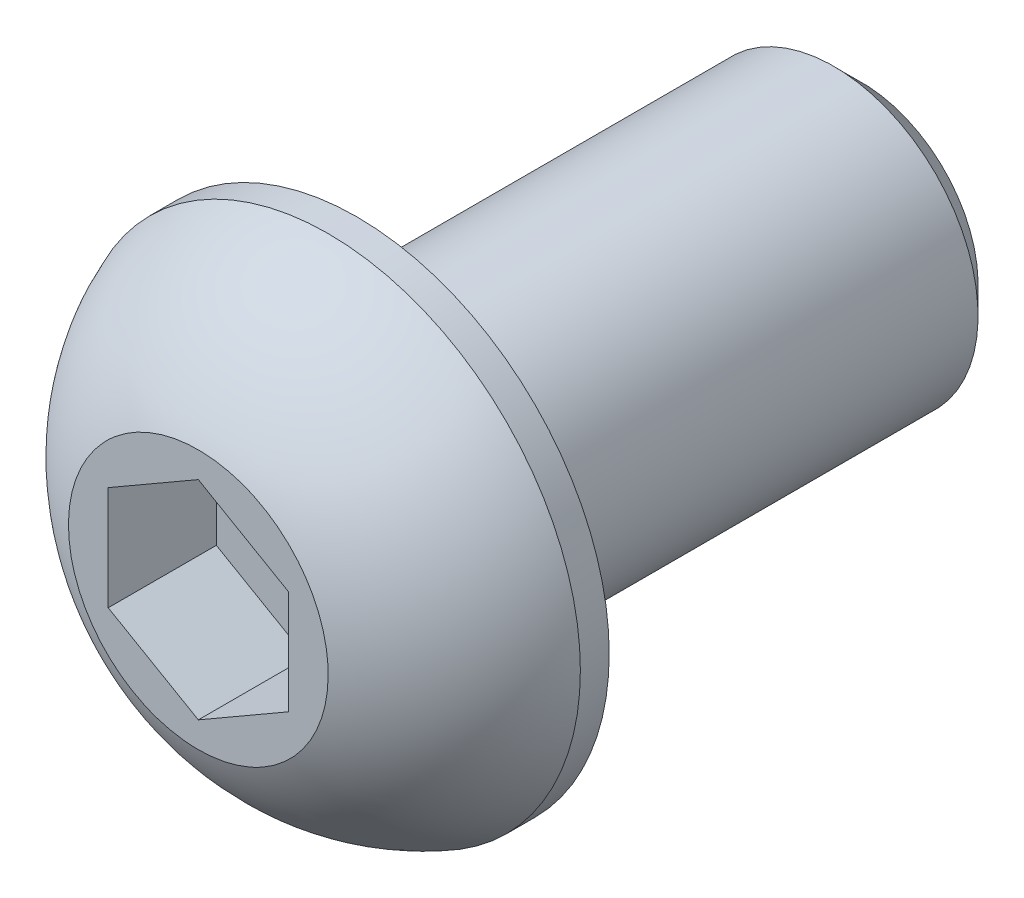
ISO-10303-21;
HEADER;
FILE_DESCRIPTION(('STEP AP214'),'2;1');
FILE_NAME('part.step','',(''),(''),'','','');
FILE_SCHEMA(('AUTOMOTIVE_DESIGN { 1 0 10303 214 1 1 1 1 }'));
ENDSEC;
DATA;
#1=APPLICATION_CONTEXT('core data for automotive mechanical design processes');
#2=APPLICATION_PROTOCOL_DEFINITION('international standard','automotive_design',2000,#1);
#3=PRODUCT_CONTEXT('',#1,'mechanical');
#4=PRODUCT('Part','Part','',(#3));
#5=PRODUCT_RELATED_PRODUCT_CATEGORY('part','',(#4));
#6=PRODUCT_DEFINITION_FORMATION('','',#4);
#7=PRODUCT_DEFINITION_CONTEXT('part definition',#1,'design');
#8=PRODUCT_DEFINITION('design','',#6,#7);
#9=PRODUCT_DEFINITION_SHAPE('','',#8);
#10=(LENGTH_UNIT() NAMED_UNIT(*) SI_UNIT(.MILLI.,.METRE.));
#11=(NAMED_UNIT(*) PLANE_ANGLE_UNIT() SI_UNIT($,.RADIAN.));
#12=(NAMED_UNIT(*) SI_UNIT($,.STERADIAN.) SOLID_ANGLE_UNIT());
#13=UNCERTAINTY_MEASURE_WITH_UNIT(LENGTH_MEASURE(1.E-05),#10,'distance_accuracy_value','');
#14=(GEOMETRIC_REPRESENTATION_CONTEXT(3) GLOBAL_UNCERTAINTY_ASSIGNED_CONTEXT((#13)) GLOBAL_UNIT_ASSIGNED_CONTEXT((#10,
#11,#12)) REPRESENTATION_CONTEXT('',''));
#15=CARTESIAN_POINT('',(0.,0.,0.));
#16=DIRECTION('',(0.,0.,1.));
#17=DIRECTION('',(1.,0.,0.));
#18=AXIS2_PLACEMENT_3D('',#15,#16,#17);
#19=CARTESIAN_POINT('',(0.,0.,1.4));
#20=DIRECTION('',(0.,0.,-1.));
#21=DIRECTION('',(-1.,0.,0.));
#22=AXIS2_PLACEMENT_3D('',#19,#20,#21);
#23=PLANE('',#22);
#24=DIRECTION('',(-0.866025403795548,0.499999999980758,0.));
#25=VECTOR('',#24,1.);
#26=CARTESIAN_POINT('',(1.25,2.16506350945,1.4));
#27=LINE('',#26,#25);
#28=CARTESIAN_POINT('',(2.5,1.443375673,1.4));
#29=VERTEX_POINT('',#28);
#30=CARTESIAN_POINT('',(0.,2.8867513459,1.4));
#31=VERTEX_POINT('',#30);
#32=EDGE_CURVE('E227',#29,#31,#27,.T.);
#33=ORIENTED_EDGE('',*,*,#32,.T.);
#34=DIRECTION('',(-0.866025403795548,-0.499999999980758,0.));
#35=VECTOR('',#34,1.);
#36=CARTESIAN_POINT('',(-1.25,2.16506350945,1.4));
#37=LINE('',#36,#35);
#38=CARTESIAN_POINT('',(-2.5,1.443375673,1.4));
#39=VERTEX_POINT('',#38);
#40=EDGE_CURVE('E232',#31,#39,#37,.T.);
#41=ORIENTED_EDGE('',*,*,#40,.T.);
#42=DIRECTION('',(0.,1.,0.));
#43=VECTOR('',#42,1.);
#44=CARTESIAN_POINT('',(-2.5,0.,1.4));
#45=LINE('',#44,#43);
#46=CARTESIAN_POINT('',(-2.5,-1.443375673,1.4));
#47=VERTEX_POINT('',#46);
#48=EDGE_CURVE('E237',#39,#47,#45,.F.);
#49=ORIENTED_EDGE('',*,*,#48,.T.);
#50=DIRECTION('',(0.866025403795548,-0.499999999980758,0.));
#51=VECTOR('',#50,1.);
#52=CARTESIAN_POINT('',(-1.25,-2.16506350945,1.4));
#53=LINE('',#52,#51);
#54=CARTESIAN_POINT('',(0.,-2.8867513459,1.4));
#55=VERTEX_POINT('',#54);
#56=EDGE_CURVE('E94',#47,#55,#53,.T.);
#57=ORIENTED_EDGE('',*,*,#56,.T.);
#58=DIRECTION('',(0.866025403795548,0.499999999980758,0.));
#59=VECTOR('',#58,1.);
#60=CARTESIAN_POINT('',(1.25,-2.16506350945,1.4));
#61=LINE('',#60,#59);
#62=CARTESIAN_POINT('',(2.5,-1.443375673,1.4));
#63=VERTEX_POINT('',#62);
#64=EDGE_CURVE('E78',#55,#63,#61,.T.);
#65=ORIENTED_EDGE('',*,*,#64,.T.);
#66=DIRECTION('',(0.,1.,0.));
#67=VECTOR('',#66,1.);
#68=CARTESIAN_POINT('',(2.5,0.7216878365,1.4));
#69=LINE('',#68,#67);
#70=EDGE_CURVE('E83',#63,#29,#69,.T.);
#71=ORIENTED_EDGE('',*,*,#70,.T.);
#72=EDGE_LOOP('',(#33,#41,#49,#57,#65,#71));
#73=FACE_BOUND('',#72,.T.);
#74=ADVANCED_FACE('F20',(#73),#23,.F.);
#75=CARTESIAN_POINT('',(2.5,0.7216878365,4.4));
#76=DIRECTION('',(1.,0.,0.));
#77=DIRECTION('',(0.,0.,-1.));
#78=AXIS2_PLACEMENT_3D('',#75,#76,#77);
#79=PLANE('',#78);
#80=DIRECTION('',(0.,0.,1.));
#81=VECTOR('',#80,1.);
#82=CARTESIAN_POINT('',(2.5,-1.443375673,4.4));
#83=LINE('',#82,#81);
#84=CARTESIAN_POINT('',(2.5,-1.443375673,4.39999999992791));
#85=VERTEX_POINT('',#84);
#86=EDGE_CURVE('E85',#63,#85,#83,.T.);
#87=ORIENTED_EDGE('',*,*,#86,.T.);
#88=DIRECTION('',(0.,1.,0.));
#89=VECTOR('',#88,1.);
#90=CARTESIAN_POINT('',(2.5,0.,4.39999999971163));
#91=LINE('',#90,#89);
#92=CARTESIAN_POINT('',(2.5,1.443375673,4.39999999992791));
#93=VERTEX_POINT('',#92);
#94=EDGE_CURVE('E225',#93,#85,#91,.F.);
#95=ORIENTED_EDGE('',*,*,#94,.F.);
#96=DIRECTION('',(0.,0.,1.));
#97=VECTOR('',#96,1.);
#98=CARTESIAN_POINT('',(2.5,1.443375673,4.4));
#99=LINE('',#98,#97);
#100=EDGE_CURVE('E88',#93,#29,#99,.F.);
#101=ORIENTED_EDGE('',*,*,#100,.T.);
#102=ORIENTED_EDGE('',*,*,#70,.F.);
#103=EDGE_LOOP('',(#87,#95,#101,#102));
#104=FACE_BOUND('',#103,.T.);
#105=ADVANCED_FACE('F84',(#104),#79,.F.);
#106=CARTESIAN_POINT('',(1.25,-2.16506350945,4.4));
#107=DIRECTION('',(0.499999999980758,-0.866025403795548,0.));
#108=DIRECTION('',(0.866025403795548,0.499999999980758,0.));
#109=AXIS2_PLACEMENT_3D('',#106,#107,#108);
#110=PLANE('',#109);
#111=DIRECTION('',(0.,0.,1.));
#112=VECTOR('',#111,1.);
#113=CARTESIAN_POINT('',(0.,-2.8867513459,4.4));
#114=LINE('',#113,#112);
#115=CARTESIAN_POINT('',(0.,-2.8867513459,4.39999999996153));
#116=VERTEX_POINT('',#115);
#117=EDGE_CURVE('E96',#55,#116,#114,.T.);
#118=ORIENTED_EDGE('',*,*,#117,.T.);
#119=DIRECTION('',(-0.866025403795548,-0.499999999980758,4.65924845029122E-11));
#120=VECTOR('',#119,1.);
#121=CARTESIAN_POINT('',(2.5,-1.443375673,4.39999999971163));
#122=LINE('',#121,#120);
#123=EDGE_CURVE('E100',#85,#116,#122,.T.);
#124=ORIENTED_EDGE('',*,*,#123,.F.);
#125=ORIENTED_EDGE('',*,*,#86,.F.);
#126=ORIENTED_EDGE('',*,*,#64,.F.);
#127=EDGE_LOOP('',(#118,#124,#125,#126));
#128=FACE_BOUND('',#127,.T.);
#129=ADVANCED_FACE('F98',(#128),#110,.F.);
#130=CARTESIAN_POINT('',(-1.25,-2.16506350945,4.4));
#131=DIRECTION('',(-0.499999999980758,-0.866025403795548,0.));
#132=DIRECTION('',(0.866025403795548,-0.499999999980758,0.));
#133=AXIS2_PLACEMENT_3D('',#130,#131,#132);
#134=PLANE('',#133);
#135=DIRECTION('',(0.,0.,1.));
#136=VECTOR('',#135,1.);
#137=CARTESIAN_POINT('',(-2.5,-1.443375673,4.4));
#138=LINE('',#137,#136);
#139=CARTESIAN_POINT('',(-2.5,-1.443375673,4.39999999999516));
#140=VERTEX_POINT('',#139);
#141=EDGE_CURVE('E239',#47,#140,#138,.T.);
#142=ORIENTED_EDGE('',*,*,#141,.T.);
#143=DIRECTION('',(-0.866025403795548,0.499999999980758,4.65924845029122E-11));
#144=VECTOR('',#143,1.);
#145=CARTESIAN_POINT('',(0.,-2.8867513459,4.39999999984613));
#146=LINE('',#145,#144);
#147=EDGE_CURVE('E221',#116,#140,#146,.T.);
#148=ORIENTED_EDGE('',*,*,#147,.F.);
#149=ORIENTED_EDGE('',*,*,#117,.F.);
#150=ORIENTED_EDGE('',*,*,#56,.F.);
#151=EDGE_LOOP('',(#142,#148,#149,#150));
#152=FACE_BOUND('',#151,.T.);
#153=ADVANCED_FACE('F141',(#152),#134,.F.);
#154=CARTESIAN_POINT('',(-2.5,0.,4.4));
#155=DIRECTION('',(-1.,0.,0.));
#156=DIRECTION('',(0.,0.,1.));
#157=AXIS2_PLACEMENT_3D('',#154,#155,#156);
#158=PLANE('',#157);
#159=DIRECTION('',(0.,0.,1.));
#160=VECTOR('',#159,1.);
#161=CARTESIAN_POINT('',(-2.5,1.443375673,4.4));
#162=LINE('',#161,#160);
#163=CARTESIAN_POINT('',(-2.5,1.443375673,4.39999999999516));
#164=VERTEX_POINT('',#163);
#165=EDGE_CURVE('E235',#39,#164,#162,.T.);
#166=ORIENTED_EDGE('',*,*,#165,.T.);
#167=DIRECTION('',(0.,1.,0.));
#168=VECTOR('',#167,1.);
#169=CARTESIAN_POINT('',(-2.5,0.,4.39999999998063));
#170=LINE('',#169,#168);
#171=EDGE_CURVE('E218',#140,#164,#170,.T.);
#172=ORIENTED_EDGE('',*,*,#171,.F.);
#173=ORIENTED_EDGE('',*,*,#141,.F.);
#174=ORIENTED_EDGE('',*,*,#48,.F.);
#175=EDGE_LOOP('',(#166,#172,#173,#174));
#176=FACE_BOUND('',#175,.T.);
#177=ADVANCED_FACE('F137',(#176),#158,.F.);
#178=CARTESIAN_POINT('',(-1.25,2.16506350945,4.4));
#179=DIRECTION('',(-0.499999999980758,0.866025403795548,0.));
#180=DIRECTION('',(-0.866025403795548,-0.499999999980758,0.));
#181=AXIS2_PLACEMENT_3D('',#178,#179,#180);
#182=PLANE('',#181);
#183=DIRECTION('',(0.,0.,1.));
#184=VECTOR('',#183,1.);
#185=CARTESIAN_POINT('',(0.,2.8867513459,4.4));
#186=LINE('',#185,#184);
#187=CARTESIAN_POINT('',(0.,2.8867513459,4.39999999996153));
#188=VERTEX_POINT('',#187);
#189=EDGE_CURVE('E230',#31,#188,#186,.T.);
#190=ORIENTED_EDGE('',*,*,#189,.T.);
#191=DIRECTION('',(0.866025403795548,0.499999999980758,-4.65924845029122E-11));
#192=VECTOR('',#191,1.);
#193=CARTESIAN_POINT('',(-2.5,1.443375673,4.39999999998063));
#194=LINE('',#193,#192);
#195=EDGE_CURVE('E215',#164,#188,#194,.T.);
#196=ORIENTED_EDGE('',*,*,#195,.F.);
#197=ORIENTED_EDGE('',*,*,#165,.F.);
#198=ORIENTED_EDGE('',*,*,#40,.F.);
#199=EDGE_LOOP('',(#190,#196,#197,#198));
#200=FACE_BOUND('',#199,.T.);
#201=ADVANCED_FACE('F133',(#200),#182,.F.);
#202=CARTESIAN_POINT('',(1.25,2.16506350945,4.4));
#203=DIRECTION('',(0.499999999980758,0.866025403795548,0.));
#204=DIRECTION('',(-0.866025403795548,0.499999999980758,0.));
#205=AXIS2_PLACEMENT_3D('',#202,#203,#204);
#206=PLANE('',#205);
#207=ORIENTED_EDGE('',*,*,#100,.F.);
#208=DIRECTION('',(0.866025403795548,-0.499999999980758,-4.65924845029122E-11));
#209=VECTOR('',#208,1.);
#210=CARTESIAN_POINT('',(0.,2.8867513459,4.39999999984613));
#211=LINE('',#210,#209);
#212=EDGE_CURVE('E120',#188,#93,#211,.T.);
#213=ORIENTED_EDGE('',*,*,#212,.F.);
#214=ORIENTED_EDGE('',*,*,#189,.F.);
#215=ORIENTED_EDGE('',*,*,#32,.F.);
#216=EDGE_LOOP('',(#207,#213,#214,#215));
#217=FACE_BOUND('',#216,.T.);
#218=ADVANCED_FACE('F129',(#217),#206,.F.);
#219=CARTESIAN_POINT('',(-3.23151399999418,0.,4.40000000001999));
#220=DIRECTION('',(5.38003067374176E-11,0.,1.));
#221=DIRECTION('',(1.,0.,-5.38003067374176E-11));
#222=AXIS2_PLACEMENT_3D('',#219,#220,#221);
#223=PLANE('',#222);
#224=CARTESIAN_POINT('',(3.60302800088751,0.,4.39999999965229));
#225=CARTESIAN_POINT('',(3.60302739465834,-0.101161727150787,4.39999999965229));
#226=CARTESIAN_POINT('',(3.59876373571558,-0.202342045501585,4.39999999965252));
#227=CARTESIAN_POINT('',(3.5817368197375,-0.404003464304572,4.39999999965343));
#228=CARTESIAN_POINT('',(3.56897105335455,-0.504484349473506,4.39999999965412));
#229=CARTESIAN_POINT('',(3.53499735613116,-0.704182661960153,4.39999999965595));
#230=CARTESIAN_POINT('',(3.51377602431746,-0.803397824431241,4.39999999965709));
#231=CARTESIAN_POINT('',(3.46303747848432,-0.999742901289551,4.39999999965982));
#232=CARTESIAN_POINT('',(3.43351353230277,-1.0968710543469,4.39999999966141));
#233=CARTESIAN_POINT('',(3.33289595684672,-1.38366869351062,4.39999999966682));
#234=CARTESIAN_POINT('',(3.2496739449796,-1.56923401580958,4.3999999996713));
#235=CARTESIAN_POINT('',(3.05321325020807,-1.92373837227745,4.39999999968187));
#236=CARTESIAN_POINT('',(2.93997342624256,-2.09267677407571,4.39999999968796));
#237=CARTESIAN_POINT('',(2.7501783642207,-2.3299437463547,4.39999999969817));
#238=CARTESIAN_POINT('',(2.68354067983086,-2.40638732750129,4.39999999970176));
#239=CARTESIAN_POINT('',(2.54411499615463,-2.55333638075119,4.39999999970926));
#240=CARTESIAN_POINT('',(2.47133298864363,-2.62384750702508,4.39999999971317));
#241=CARTESIAN_POINT('',(2.32005283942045,-2.75851860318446,4.39999999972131));
#242=CARTESIAN_POINT('',(2.2415521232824,-2.82267568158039,4.39999999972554));
#243=CARTESIAN_POINT('',(2.07943216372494,-2.94415515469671,4.39999999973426));
#244=CARTESIAN_POINT('',(1.9958117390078,-3.00147596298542,4.39999999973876));
#245=CARTESIAN_POINT('',(1.73818269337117,-3.16250597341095,4.39999999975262));
#246=CARTESIAN_POINT('',(1.5572464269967,-3.25542481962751,4.39999999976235));
#247=CARTESIAN_POINT('',(1.18243980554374,-3.40951047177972,4.39999999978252));
#248=CARTESIAN_POINT('',(0.988569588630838,-3.47067761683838,4.39999999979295));
#249=CARTESIAN_POINT('',(0.593286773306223,-3.55961210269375,4.39999999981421));
#250=CARTESIAN_POINT('',(0.391874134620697,-3.58737926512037,4.39999999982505));
#251=CARTESIAN_POINT('',(-0.0127538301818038,-3.60869681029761,4.39999999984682));
#252=CARTESIAN_POINT('',(-0.21596915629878,-3.60224719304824,4.39999999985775));
#253=CARTESIAN_POINT('',(-0.618408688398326,-3.55534015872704,4.3999999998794));
#254=CARTESIAN_POINT('',(-0.817632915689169,-3.51488292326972,4.39999999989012));
#255=CARTESIAN_POINT('',(-1.20655549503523,-3.40103381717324,4.39999999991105));
#256=CARTESIAN_POINT('',(-1.39625374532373,-3.3276415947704,4.39999999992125));
#257=CARTESIAN_POINT('',(-1.66937712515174,-3.19457390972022,4.39999999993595));
#258=CARTESIAN_POINT('',(-1.75855773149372,-3.14635700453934,4.39999999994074));
#259=CARTESIAN_POINT('',(-1.93254490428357,-3.04258510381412,4.3999999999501));
#260=CARTESIAN_POINT('',(-2.01735247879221,-2.98703181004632,4.39999999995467));
#261=CARTESIAN_POINT('',(-2.18194598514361,-2.86900229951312,4.39999999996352));
#262=CARTESIAN_POINT('',(-2.26173417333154,-2.80652922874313,4.39999999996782));
#263=CARTESIAN_POINT('',(-2.41582896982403,-2.67504409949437,4.39999999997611));
#264=CARTESIAN_POINT('',(-2.49013021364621,-2.60602578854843,4.3999999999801));
#265=CARTESIAN_POINT('',(-2.70380588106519,-2.39001539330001,4.3999999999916));
#266=CARTESIAN_POINT('',(-2.83417035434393,-2.23391111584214,4.39999999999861));
#267=CARTESIAN_POINT('',(-3.0667937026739,-1.90201275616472,4.40000000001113));
#268=CARTESIAN_POINT('',(-3.16905364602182,-1.7262194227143,4.40000000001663));
#269=CARTESIAN_POINT('',(-3.29925003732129,-1.45158205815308,4.40000000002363));
#270=CARTESIAN_POINT('',(-3.3388164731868,-1.35809388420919,4.40000000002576));
#271=CARTESIAN_POINT('',(-3.40990547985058,-1.16816720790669,4.40000000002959));
#272=CARTESIAN_POINT('',(-3.44143456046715,-1.07173116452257,4.40000000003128));
#273=CARTESIAN_POINT('',(-3.49620387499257,-0.876708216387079,4.40000000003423));
#274=CARTESIAN_POINT('',(-3.51945719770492,-0.778124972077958,4.40000000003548));
#275=CARTESIAN_POINT('',(-3.5575798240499,-0.579369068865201,4.40000000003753));
#276=CARTESIAN_POINT('',(-3.57245160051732,-0.479196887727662,4.40000000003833));
#277=CARTESIAN_POINT('',(-3.58972538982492,-0.3157245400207,4.40000000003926));
#278=CARTESIAN_POINT('',(-3.59471229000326,-0.252686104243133,4.40000000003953));
#279=CARTESIAN_POINT('',(-3.60136378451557,-0.12643419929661,4.40000000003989));
#280=CARTESIAN_POINT('',(-3.60302837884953,-0.0632207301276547,4.40000000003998));
#281=CARTESIAN_POINT('',(-3.60302739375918,0.101161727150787,4.40000000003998));
#282=CARTESIAN_POINT('',(-3.59876373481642,0.202342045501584,4.40000000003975));
#283=CARTESIAN_POINT('',(-3.58173681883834,0.40400346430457,4.40000000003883));
#284=CARTESIAN_POINT('',(-3.56897105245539,0.504484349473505,4.40000000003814));
#285=CARTESIAN_POINT('',(-3.534997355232,0.704182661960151,4.40000000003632));
#286=CARTESIAN_POINT('',(-3.5137760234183,0.803397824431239,4.40000000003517));
#287=CARTESIAN_POINT('',(-3.46303747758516,0.99974290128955,4.40000000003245));
#288=CARTESIAN_POINT('',(-3.43351353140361,1.0968710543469,4.40000000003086));
#289=CARTESIAN_POINT('',(-3.33289595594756,1.38366869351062,4.40000000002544));
#290=CARTESIAN_POINT('',(-3.24967394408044,1.56923401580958,4.40000000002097));
#291=CARTESIAN_POINT('',(-3.05321324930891,1.92373837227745,4.4000000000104));
#292=CARTESIAN_POINT('',(-2.93997342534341,2.09267677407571,4.4000000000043));
#293=CARTESIAN_POINT('',(-2.75017836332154,2.3299437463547,4.39999999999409));
#294=CARTESIAN_POINT('',(-2.6835406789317,2.40638732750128,4.39999999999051));
#295=CARTESIAN_POINT('',(-2.54411499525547,2.55333638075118,4.39999999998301));
#296=CARTESIAN_POINT('',(-2.47133298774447,2.62384750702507,4.39999999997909));
#297=CARTESIAN_POINT('',(-2.3200528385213,2.75851860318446,4.39999999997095));
#298=CARTESIAN_POINT('',(-2.24155212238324,2.82267568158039,4.39999999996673));
#299=CARTESIAN_POINT('',(-2.07943216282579,2.94415515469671,4.39999999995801));
#300=CARTESIAN_POINT('',(-1.99581173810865,3.00147596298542,4.39999999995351));
#301=CARTESIAN_POINT('',(-1.73818269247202,3.16250597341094,4.39999999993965));
#302=CARTESIAN_POINT('',(-1.55724642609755,3.2554248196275,4.39999999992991));
#303=CARTESIAN_POINT('',(-1.18243980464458,3.40951047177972,4.39999999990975));
#304=CARTESIAN_POINT('',(-0.988569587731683,3.47067761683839,4.39999999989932));
#305=CARTESIAN_POINT('',(-0.593286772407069,3.55961210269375,4.39999999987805));
#306=CARTESIAN_POINT('',(-0.391874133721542,3.58737926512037,4.39999999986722));
#307=CARTESIAN_POINT('',(0.0127538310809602,3.60869681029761,4.39999999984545));
#308=CARTESIAN_POINT('',(0.215969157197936,3.60224719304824,4.39999999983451));
#309=CARTESIAN_POINT('',(0.618408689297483,3.55534015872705,4.39999999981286));
#310=CARTESIAN_POINT('',(0.817632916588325,3.51488292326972,4.39999999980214));
#311=CARTESIAN_POINT('',(1.20655549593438,3.40103381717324,4.39999999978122));
#312=CARTESIAN_POINT('',(1.39625374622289,3.32764159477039,4.39999999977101));
#313=CARTESIAN_POINT('',(1.66937712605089,3.19457390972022,4.39999999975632));
#314=CARTESIAN_POINT('',(1.75855773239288,3.14635700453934,4.39999999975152));
#315=CARTESIAN_POINT('',(1.93254490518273,3.04258510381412,4.39999999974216));
#316=CARTESIAN_POINT('',(2.01735247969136,2.98703181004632,4.3999999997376));
#317=CARTESIAN_POINT('',(2.18194598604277,2.86900229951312,4.39999999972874));
#318=CARTESIAN_POINT('',(2.2617341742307,2.80652922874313,4.39999999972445));
#319=CARTESIAN_POINT('',(2.41582897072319,2.67504409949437,4.39999999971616));
#320=CARTESIAN_POINT('',(2.49013021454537,2.60602578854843,4.39999999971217));
#321=CARTESIAN_POINT('',(2.70380588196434,2.39001539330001,4.39999999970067));
#322=CARTESIAN_POINT('',(2.83417035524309,2.23391111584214,4.39999999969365));
#323=CARTESIAN_POINT('',(3.06679370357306,1.90201275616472,4.39999999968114));
#324=CARTESIAN_POINT('',(3.16905364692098,1.7262194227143,4.39999999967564));
#325=CARTESIAN_POINT('',(3.29925003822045,1.45158205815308,4.39999999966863));
#326=CARTESIAN_POINT('',(3.33881647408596,1.35809388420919,4.3999999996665));
#327=CARTESIAN_POINT('',(3.40990548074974,1.16816720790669,4.39999999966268));
#328=CARTESIAN_POINT('',(3.44143456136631,1.07173116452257,4.39999999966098));
#329=CARTESIAN_POINT('',(3.49620387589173,0.876708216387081,4.39999999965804));
#330=CARTESIAN_POINT('',(3.51945719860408,0.77812497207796,4.39999999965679));
#331=CARTESIAN_POINT('',(3.55757982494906,0.579369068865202,4.39999999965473));
#332=CARTESIAN_POINT('',(3.57245160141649,0.479196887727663,4.39999999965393));
#333=CARTESIAN_POINT('',(3.58972539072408,0.3157245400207,4.399999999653));
#334=CARTESIAN_POINT('',(3.59471229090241,0.252686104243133,4.39999999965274));
#335=CARTESIAN_POINT('',(3.60136378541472,0.12643419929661,4.39999999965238));
#336=CARTESIAN_POINT('',(3.60302837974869,0.0632207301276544,4.39999999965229));
#337=CARTESIAN_POINT('',(3.60302800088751,0.,4.39999999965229));
#338=B_SPLINE_CURVE_WITH_KNOTS('',3,(#224,#225,#226,#227,#228,#229,#230,#231,#232,#233,#234,
#235,#236,#237,#238,#239,#240,#241,#242,#243,#244,#245,#246,#247,#248,#249,#250,#251,#252,#253,
#254,#255,#256,#257,#258,#259,#260,#261,#262,#263,#264,#265,#266,#267,#268,#269,#270,#271,#272,
#273,#274,#275,#276,#277,#278,#279,#280,#281,#282,#283,#284,#285,#286,#287,#288,#289,#290,#291,
#292,#293,#294,#295,#296,#297,#298,#299,#300,#301,#302,#303,#304,#305,#306,#307,#308,#309,#310,
#311,#312,#313,#314,#315,#316,#317,#318,#319,#320,#321,#322,#323,#324,#325,#326,#327,#328,#329,
#330,#331,#332,#333,#334,#335,#336,#337),.UNSPECIFIED.,.T.,.F.,(4,2,2,2,2,2,2,2,2,2,2,2,2,2,2,2,
2,2,2,2,2,2,2,2,2,2,2,2,2,2,2,2,2,2,2,2,2,2,2,2,2,2,2,2,2,2,2,2,2,2,2,2,2,2,2,2,4),(0.,
0.303426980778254,0.606943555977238,0.910943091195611,1.21518983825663,1.82223302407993,
2.42929928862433,2.73323016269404,3.03686800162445,3.34064338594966,3.64448912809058,
4.25154709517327,4.85859857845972,5.46565330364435,6.07270802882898,6.67975951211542,
7.28681747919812,7.59066322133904,7.89443860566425,8.19807644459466,8.50200731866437,
9.10907358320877,9.71611676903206,10.0203635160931,10.3243630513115,10.6278796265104,
10.9313066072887,11.1209324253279,11.3105582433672,11.6139852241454,11.9175017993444,
12.2215013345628,12.5257480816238,13.1327912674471,13.7398575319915,14.0437884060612,
14.3474262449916,14.6512016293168,14.9550473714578,15.5621053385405,16.1691568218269,
16.7762115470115,17.3832662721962,17.9903177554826,18.5973757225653,18.9012214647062,
19.2049968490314,19.5086346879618,19.8125655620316,20.4196318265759,21.0266750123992,
21.3309217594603,21.6349212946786,21.9384378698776,22.2418648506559,22.4314906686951,
22.6211164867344),.UNSPECIFIED.);
#339=CARTESIAN_POINT('',(3.60302800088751,0.,4.39999999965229));
#340=VERTEX_POINT('',#339);
#341=EDGE_CURVE('E113',#340,#340,#338,.T.);
#342=ORIENTED_EDGE('',*,*,#341,.F.);
#343=EDGE_LOOP('',(#342));
#344=FACE_BOUND('',#343,.T.);
#345=ORIENTED_EDGE('',*,*,#195,.T.);
#346=ORIENTED_EDGE('',*,*,#212,.T.);
#347=ORIENTED_EDGE('',*,*,#94,.T.);
#348=ORIENTED_EDGE('',*,*,#123,.T.);
#349=ORIENTED_EDGE('',*,*,#147,.T.);
#350=ORIENTED_EDGE('',*,*,#171,.T.);
#351=EDGE_LOOP('',(#345,#346,#347,#348,#349,#350));
#352=FACE_BOUND('',#351,.T.);
#353=ADVANCED_FACE('F125',(#344,#352),#223,.T.);
#354=CARTESIAN_POINT('',(1.129567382,0.,-1.3366627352));
#355=DIRECTION('',(0.,-1.,0.));
#356=DIRECTION('',(1.,0.,0.));
#357=AXIS2_PLACEMENT_3D('',#354,#355,#356);
#358=CIRCLE('',#357,6.2471839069);
#359=TRIMMED_CURVE('',#358,(PARAMETER_VALUE(-1.75260857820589)),
(PARAMETER_VALUE(1.75260857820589)),.T.,.PARAMETER.);
#360=CARTESIAN_POINT('',(0.,0.,-1.3366627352));
#361=DIRECTION('',(0.,0.,-1.));
#362=AXIS1_PLACEMENT('',#360,#361);
#363=SURFACE_OF_REVOLUTION('',#359,#362);
#364=ORIENTED_EDGE('',*,*,#341,.T.);
#365=EDGE_LOOP('',(#364));
#366=FACE_BOUND('',#365,.T.);
#367=CARTESIAN_POINT('',(0.,0.,0.8));
#368=DIRECTION('',(0.,0.,-1.));
#369=DIRECTION('',(-1.,0.,0.));
#370=AXIS2_PLACEMENT_3D('',#367,#368,#369);
#371=CIRCLE('',#370,7.);
#372=CARTESIAN_POINT('',(-7.,0.,0.8));
#373=VERTEX_POINT('',#372);
#374=EDGE_CURVE('E112',#373,#373,#371,.T.);
#375=ORIENTED_EDGE('',*,*,#374,.F.);
#376=EDGE_LOOP('',(#375));
#377=FACE_BOUND('',#376,.T.);
#378=ADVANCED_FACE('F121',(#366,#377),#363,.F.);
#379=CARTESIAN_POINT('',(0.,0.,0.399999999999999));
#380=DIRECTION('',(0.,0.,-1.));
#381=DIRECTION('',(-1.,0.,0.));
#382=AXIS2_PLACEMENT_3D('',#379,#380,#381);
#383=CYLINDRICAL_SURFACE('',#382,7.);
#384=CARTESIAN_POINT('',(0.,0.,0.));
#385=DIRECTION('',(0.,0.,-1.));
#386=DIRECTION('',(-1.,0.,0.));
#387=AXIS2_PLACEMENT_3D('',#384,#385,#386);
#388=CIRCLE('',#387,7.);
#389=CARTESIAN_POINT('',(-7.,0.,0.));
#390=VERTEX_POINT('',#389);
#391=EDGE_CURVE('E108',#390,#390,#388,.T.);
#392=ORIENTED_EDGE('',*,*,#391,.F.);
#393=EDGE_LOOP('',(#392));
#394=FACE_BOUND('',#393,.T.);
#395=ORIENTED_EDGE('',*,*,#374,.T.);
#396=EDGE_LOOP('',(#395));
#397=FACE_BOUND('',#396,.T.);
#398=ADVANCED_FACE('F188',(#394,#397),#383,.T.);
#399=CARTESIAN_POINT('',(-5.7,0.,0.));
#400=DIRECTION('',(0.,0.,-1.));
#401=DIRECTION('',(-1.,0.,0.));
#402=AXIS2_PLACEMENT_3D('',#399,#400,#401);
#403=PLANE('',#402);
#404=ORIENTED_EDGE('',*,*,#391,.T.);
#405=EDGE_LOOP('',(#404));
#406=FACE_BOUND('',#405,.T.);
#407=CARTESIAN_POINT('',(0.,0.,0.));
#408=DIRECTION('',(0.,0.,-1.));
#409=DIRECTION('',(-1.,0.,0.));
#410=AXIS2_PLACEMENT_3D('',#407,#408,#409);
#411=CIRCLE('',#410,4.4);
#412=CARTESIAN_POINT('',(4.4,0.,0.));
#413=VERTEX_POINT('',#412);
#414=CARTESIAN_POINT('',(-4.4,0.,0.));
#415=VERTEX_POINT('',#414);
#416=EDGE_CURVE('E39',#413,#415,#411,.F.);
#417=ORIENTED_EDGE('',*,*,#416,.T.);
#418=CARTESIAN_POINT('',(0.,0.,0.));
#419=DIRECTION('',(0.,0.,-1.));
#420=DIRECTION('',(1.,0.,0.));
#421=AXIS2_PLACEMENT_3D('',#418,#419,#420);
#422=CIRCLE('',#421,4.4);
#423=EDGE_CURVE('E111',#415,#413,#422,.F.);
#424=ORIENTED_EDGE('',*,*,#423,.T.);
#425=EDGE_LOOP('',(#417,#424));
#426=FACE_BOUND('',#425,.T.);
#427=ADVANCED_FACE('F180',(#406,#426),#403,.T.);
#428=CARTESIAN_POINT('',(-1.6166,0.,-14.));
#429=DIRECTION('',(0.,0.,-1.));
#430=DIRECTION('',(-1.,0.,0.));
#431=AXIS2_PLACEMENT_3D('',#428,#429,#430);
#432=PLANE('',#431);
#433=CARTESIAN_POINT('',(0.,0.,-13.9999999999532));
#434=DIRECTION('',(0.,0.,1.));
#435=DIRECTION('',(0.,-1.,0.));
#436=AXIS2_PLACEMENT_3D('',#433,#434,#435);
#437=CIRCLE('',#436,3.23320000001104);
#438=CARTESIAN_POINT('',(0.,-3.23320000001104,-13.9999999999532));
#439=VERTEX_POINT('',#438);
#440=EDGE_CURVE('E105',#439,#439,#437,.T.);
#441=ORIENTED_EDGE('',*,*,#440,.F.);
#442=EDGE_LOOP('',(#441));
#443=FACE_BOUND('',#442,.T.);
#444=ADVANCED_FACE('F168',(#443),#432,.T.);
#445=CARTESIAN_POINT('',(0.,0.,-0.4));
#446=DIRECTION('',(0.,0.,-1.));
#447=DIRECTION('',(1.,0.,0.));
#448=AXIS2_PLACEMENT_3D('',#445,#446,#447);
#449=TOROIDAL_SURFACE('',#448,4.4,0.400000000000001);
#450=ORIENTED_EDGE('',*,*,#416,.F.);
#451=ORIENTED_EDGE('',*,*,#423,.F.);
#452=EDGE_LOOP('',(#450,#451));
#453=FACE_BOUND('',#452,.T.);
#454=CARTESIAN_POINT('',(0.,0.,-0.4));
#455=DIRECTION('',(0.,0.,-1.));
#456=DIRECTION('',(-1.,0.,0.));
#457=AXIS2_PLACEMENT_3D('',#454,#455,#456);
#458=CIRCLE('',#457,4.);
#459=CARTESIAN_POINT('',(-4.,0.,-0.4));
#460=VERTEX_POINT('',#459);
#461=EDGE_CURVE('E31',#460,#460,#458,.T.);
#462=ORIENTED_EDGE('',*,*,#461,.F.);
#463=EDGE_LOOP('',(#462));
#464=FACE_BOUND('',#463,.T.);
#465=ADVANCED_FACE('F160',(#453,#464),#449,.F.);
#466=CARTESIAN_POINT('',(0.,0.,-13.2332000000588));
#467=DIRECTION('',(0.,0.,1.));
#468=DIRECTION('',(0.,-1.,0.));
#469=AXIS2_PLACEMENT_3D('',#466,#467,#468);
#470=CONICAL_SURFACE('',#469,3.99999999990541,0.785398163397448);
#471=ORIENTED_EDGE('',*,*,#440,.T.);
#472=EDGE_LOOP('',(#471));
#473=FACE_BOUND('',#472,.T.);
#474=CARTESIAN_POINT('',(0.,0.,-13.2332));
#475=DIRECTION('',(0.,0.,-1.));
#476=DIRECTION('',(-1.,0.,0.));
#477=AXIS2_PLACEMENT_3D('',#474,#475,#476);
#478=CIRCLE('',#477,4.);
#479=CARTESIAN_POINT('',(-4.,0.,-13.2332));
#480=VERTEX_POINT('',#479);
#481=EDGE_CURVE('E11',#480,#480,#478,.F.);
#482=ORIENTED_EDGE('',*,*,#481,.F.);
#483=EDGE_LOOP('',(#482));
#484=FACE_BOUND('',#483,.T.);
#485=ADVANCED_FACE('F154',(#473,#484),#470,.T.);
#486=CARTESIAN_POINT('',(0.,0.,-6.8166));
#487=DIRECTION('',(0.,0.,-1.));
#488=DIRECTION('',(-1.,0.,0.));
#489=AXIS2_PLACEMENT_3D('',#486,#487,#488);
#490=CYLINDRICAL_SURFACE('',#489,4.);
#491=ORIENTED_EDGE('',*,*,#461,.T.);
#492=EDGE_LOOP('',(#491));
#493=FACE_BOUND('',#492,.T.);
#494=ORIENTED_EDGE('',*,*,#481,.T.);
#495=EDGE_LOOP('',(#494));
#496=FACE_BOUND('',#495,.T.);
#497=ADVANCED_FACE('F152',(#493,#496),#490,.T.);
#498=CLOSED_SHELL('',(#74,#105,#129,#153,#177,#201,#218,#353,#378,#398,#427,#444,#465,#485,#497));
#499=MANIFOLD_SOLID_BREP('B1',#498);
#500=ADVANCED_BREP_SHAPE_REPRESENTATION('',(#18,#499),#14);
#501=SHAPE_DEFINITION_REPRESENTATION(#9,#500);
ENDSEC;
END-ISO-10303-21;
